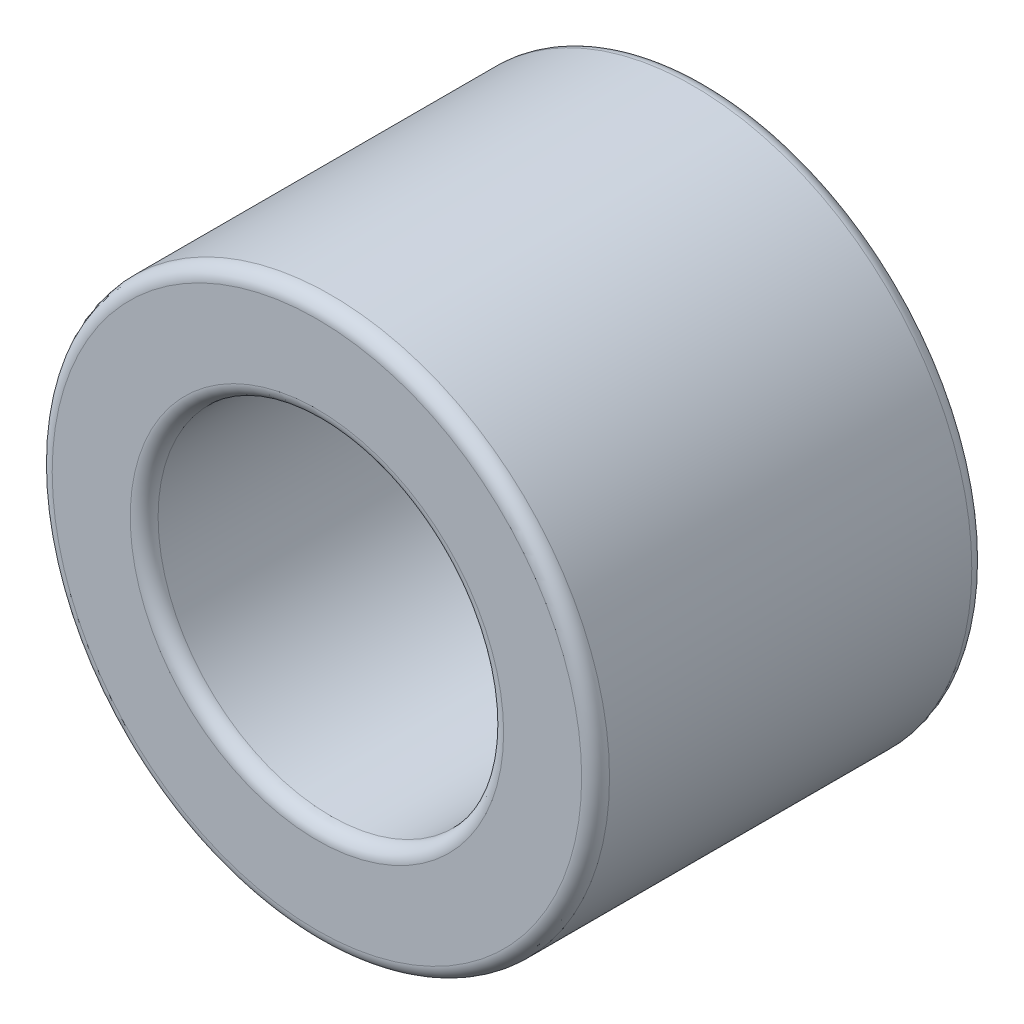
ISO-10303-21;
HEADER;
FILE_DESCRIPTION(('STEP AP214'),'2;1');
FILE_NAME('part.step','',(''),(''),'','','');
FILE_SCHEMA(('AUTOMOTIVE_DESIGN { 1 0 10303 214 1 1 1 1 }'));
ENDSEC;
DATA;
#1=APPLICATION_CONTEXT('core data for automotive mechanical design processes');
#2=APPLICATION_PROTOCOL_DEFINITION('international standard','automotive_design',2000,#1);
#3=PRODUCT_CONTEXT('',#1,'mechanical');
#4=PRODUCT('Part','Part','',(#3));
#5=PRODUCT_RELATED_PRODUCT_CATEGORY('part','',(#4));
#6=PRODUCT_DEFINITION_FORMATION('','',#4);
#7=PRODUCT_DEFINITION_CONTEXT('part definition',#1,'design');
#8=PRODUCT_DEFINITION('design','',#6,#7);
#9=PRODUCT_DEFINITION_SHAPE('','',#8);
#10=(LENGTH_UNIT() NAMED_UNIT(*) SI_UNIT(.MILLI.,.METRE.));
#11=(NAMED_UNIT(*) PLANE_ANGLE_UNIT() SI_UNIT($,.RADIAN.));
#12=(NAMED_UNIT(*) SI_UNIT($,.STERADIAN.) SOLID_ANGLE_UNIT());
#13=UNCERTAINTY_MEASURE_WITH_UNIT(LENGTH_MEASURE(1.E-05),#10,'distance_accuracy_value','');
#14=(GEOMETRIC_REPRESENTATION_CONTEXT(3) GLOBAL_UNCERTAINTY_ASSIGNED_CONTEXT((#13)) GLOBAL_UNIT_ASSIGNED_CONTEXT((#10,
#11,#12)) REPRESENTATION_CONTEXT('',''));
#15=CARTESIAN_POINT('',(0.,0.,0.));
#16=DIRECTION('',(0.,0.,1.));
#17=DIRECTION('',(1.,0.,0.));
#18=AXIS2_PLACEMENT_3D('',#15,#16,#17);
#19=CARTESIAN_POINT('',(0.,0.,7.));
#20=DIRECTION('',(0.,0.,1.));
#21=DIRECTION('',(1.,0.,0.));
#22=AXIS2_PLACEMENT_3D('',#19,#20,#21);
#23=PLANE('',#22);
#24=CARTESIAN_POINT('',(0.,0.,7.));
#25=DIRECTION('',(0.,0.,1.));
#26=DIRECTION('',(1.,0.,0.));
#27=AXIS2_PLACEMENT_3D('',#24,#25,#26);
#28=CIRCLE('',#27,6.7);
#29=CARTESIAN_POINT('',(6.7,0.,7.));
#30=VERTEX_POINT('',#29);
#31=EDGE_CURVE('E40',#30,#30,#28,.F.);
#32=ORIENTED_EDGE('',*,*,#31,.T.);
#33=EDGE_LOOP('',(#32));
#34=FACE_BOUND('',#33,.T.);
#35=CARTESIAN_POINT('',(0.,0.,7.));
#36=DIRECTION('',(0.,0.,1.));
#37=DIRECTION('',(1.,0.,0.));
#38=AXIS2_PLACEMENT_3D('',#35,#36,#37);
#39=CIRCLE('',#38,9.5);
#40=CARTESIAN_POINT('',(9.5,0.,7.));
#41=VERTEX_POINT('',#40);
#42=EDGE_CURVE('E44',#41,#41,#39,.T.);
#43=ORIENTED_EDGE('',*,*,#42,.T.);
#44=EDGE_LOOP('',(#43));
#45=FACE_BOUND('',#44,.T.);
#46=ADVANCED_FACE('F29',(#34,#45),#23,.T.);
#47=CARTESIAN_POINT('',(0.,0.,-7.));
#48=DIRECTION('',(0.,0.,1.));
#49=DIRECTION('',(1.,0.,0.));
#50=AXIS2_PLACEMENT_3D('',#47,#48,#49);
#51=PLANE('',#50);
#52=CARTESIAN_POINT('',(0.,0.,-7.));
#53=DIRECTION('',(0.,0.,1.));
#54=DIRECTION('',(1.,0.,0.));
#55=AXIS2_PLACEMENT_3D('',#52,#53,#54);
#56=CIRCLE('',#55,6.7);
#57=CARTESIAN_POINT('',(6.7,0.,-7.));
#58=VERTEX_POINT('',#57);
#59=EDGE_CURVE('E55',#58,#58,#56,.T.);
#60=ORIENTED_EDGE('',*,*,#59,.T.);
#61=EDGE_LOOP('',(#60));
#62=FACE_BOUND('',#61,.T.);
#63=CARTESIAN_POINT('',(0.,0.,-7.));
#64=DIRECTION('',(0.,0.,1.));
#65=DIRECTION('',(1.,0.,0.));
#66=AXIS2_PLACEMENT_3D('',#63,#64,#65);
#67=CIRCLE('',#66,9.5);
#68=CARTESIAN_POINT('',(9.5,0.,-7.));
#69=VERTEX_POINT('',#68);
#70=EDGE_CURVE('E58',#69,#69,#67,.F.);
#71=ORIENTED_EDGE('',*,*,#70,.T.);
#72=EDGE_LOOP('',(#71));
#73=FACE_BOUND('',#72,.T.);
#74=ADVANCED_FACE('F62',(#62,#73),#51,.F.);
#75=CARTESIAN_POINT('',(0.,0.,7.));
#76=DIRECTION('',(0.,0.,-1.));
#77=DIRECTION('',(-1.,0.,0.));
#78=AXIS2_PLACEMENT_3D('',#75,#76,#77);
#79=CYLINDRICAL_SURFACE('',#78,10.);
#80=CARTESIAN_POINT('',(0.,0.,-6.5));
#81=DIRECTION('',(0.,0.,1.));
#82=DIRECTION('',(1.,0.,0.));
#83=AXIS2_PLACEMENT_3D('',#80,#81,#82);
#84=CIRCLE('',#83,10.);
#85=CARTESIAN_POINT('',(10.,0.,-6.5));
#86=VERTEX_POINT('',#85);
#87=EDGE_CURVE('E10',#86,#86,#84,.T.);
#88=ORIENTED_EDGE('',*,*,#87,.T.);
#89=EDGE_LOOP('',(#88));
#90=FACE_BOUND('',#89,.T.);
#91=CARTESIAN_POINT('',(0.,0.,6.5));
#92=DIRECTION('',(0.,0.,1.));
#93=DIRECTION('',(1.,0.,0.));
#94=AXIS2_PLACEMENT_3D('',#91,#92,#93);
#95=CIRCLE('',#94,10.);
#96=CARTESIAN_POINT('',(10.,0.,6.5));
#97=VERTEX_POINT('',#96);
#98=EDGE_CURVE('E36',#97,#97,#95,.F.);
#99=ORIENTED_EDGE('',*,*,#98,.T.);
#100=EDGE_LOOP('',(#99));
#101=FACE_BOUND('',#100,.T.);
#102=ADVANCED_FACE('F82',(#90,#101),#79,.T.);
#103=CARTESIAN_POINT('',(0.,0.,7.));
#104=DIRECTION('',(0.,0.,-1.));
#105=DIRECTION('',(-1.,0.,0.));
#106=AXIS2_PLACEMENT_3D('',#103,#104,#105);
#107=CYLINDRICAL_SURFACE('',#106,6.2);
#108=CARTESIAN_POINT('',(0.,0.,-6.5));
#109=DIRECTION('',(0.,0.,1.));
#110=DIRECTION('',(1.,0.,0.));
#111=AXIS2_PLACEMENT_3D('',#108,#109,#110);
#112=CIRCLE('',#111,6.2);
#113=CARTESIAN_POINT('',(6.2,0.,-6.5));
#114=VERTEX_POINT('',#113);
#115=EDGE_CURVE('E49',#114,#114,#112,.F.);
#116=ORIENTED_EDGE('',*,*,#115,.T.);
#117=EDGE_LOOP('',(#116));
#118=FACE_BOUND('',#117,.T.);
#119=CARTESIAN_POINT('',(0.,0.,6.5));
#120=DIRECTION('',(0.,0.,1.));
#121=DIRECTION('',(1.,0.,0.));
#122=AXIS2_PLACEMENT_3D('',#119,#120,#121);
#123=CIRCLE('',#122,6.2);
#124=CARTESIAN_POINT('',(6.2,0.,6.5));
#125=VERTEX_POINT('',#124);
#126=EDGE_CURVE('E52',#125,#125,#123,.T.);
#127=ORIENTED_EDGE('',*,*,#126,.T.);
#128=EDGE_LOOP('',(#127));
#129=FACE_BOUND('',#128,.T.);
#130=ADVANCED_FACE('F87',(#118,#129),#107,.F.);
#131=CARTESIAN_POINT('',(0.,0.,-6.5));
#132=DIRECTION('',(0.,0.,1.));
#133=DIRECTION('',(1.,0.,0.));
#134=AXIS2_PLACEMENT_3D('',#131,#132,#133);
#135=TOROIDAL_SURFACE('',#134,6.7,0.5);
#136=ORIENTED_EDGE('',*,*,#115,.F.);
#137=EDGE_LOOP('',(#136));
#138=FACE_BOUND('',#137,.T.);
#139=ORIENTED_EDGE('',*,*,#59,.F.);
#140=EDGE_LOOP('',(#139));
#141=FACE_BOUND('',#140,.T.);
#142=ADVANCED_FACE('F73',(#138,#141),#135,.T.);
#143=CARTESIAN_POINT('',(0.,0.,6.5));
#144=DIRECTION('',(0.,0.,1.));
#145=DIRECTION('',(1.,0.,0.));
#146=AXIS2_PLACEMENT_3D('',#143,#144,#145);
#147=TOROIDAL_SURFACE('',#146,6.7,0.5);
#148=ORIENTED_EDGE('',*,*,#31,.F.);
#149=EDGE_LOOP('',(#148));
#150=FACE_BOUND('',#149,.T.);
#151=ORIENTED_EDGE('',*,*,#126,.F.);
#152=EDGE_LOOP('',(#151));
#153=FACE_BOUND('',#152,.T.);
#154=ADVANCED_FACE('F67',(#150,#153),#147,.T.);
#155=CARTESIAN_POINT('',(0.,0.,-6.5));
#156=DIRECTION('',(0.,0.,1.));
#157=DIRECTION('',(1.,0.,0.));
#158=AXIS2_PLACEMENT_3D('',#155,#156,#157);
#159=TOROIDAL_SURFACE('',#158,9.5,0.5);
#160=ORIENTED_EDGE('',*,*,#70,.F.);
#161=EDGE_LOOP('',(#160));
#162=FACE_BOUND('',#161,.T.);
#163=ORIENTED_EDGE('',*,*,#87,.F.);
#164=EDGE_LOOP('',(#163));
#165=FACE_BOUND('',#164,.T.);
#166=ADVANCED_FACE('F64',(#162,#165),#159,.T.);
#167=CARTESIAN_POINT('',(0.,0.,6.5));
#168=DIRECTION('',(0.,0.,1.));
#169=DIRECTION('',(1.,0.,0.));
#170=AXIS2_PLACEMENT_3D('',#167,#168,#169);
#171=TOROIDAL_SURFACE('',#170,9.5,0.5);
#172=ORIENTED_EDGE('',*,*,#98,.F.);
#173=EDGE_LOOP('',(#172));
#174=FACE_BOUND('',#173,.T.);
#175=ORIENTED_EDGE('',*,*,#42,.F.);
#176=EDGE_LOOP('',(#175));
#177=FACE_BOUND('',#176,.T.);
#178=ADVANCED_FACE('F31',(#174,#177),#171,.T.);
#179=CLOSED_SHELL('',(#46,#74,#102,#130,#142,#154,#166,#178));
#180=MANIFOLD_SOLID_BREP('B2',#179);
#181=ADVANCED_BREP_SHAPE_REPRESENTATION('',(#18,#180),#14);
#182=SHAPE_DEFINITION_REPRESENTATION(#9,#181);
ENDSEC;
END-ISO-10303-21;
